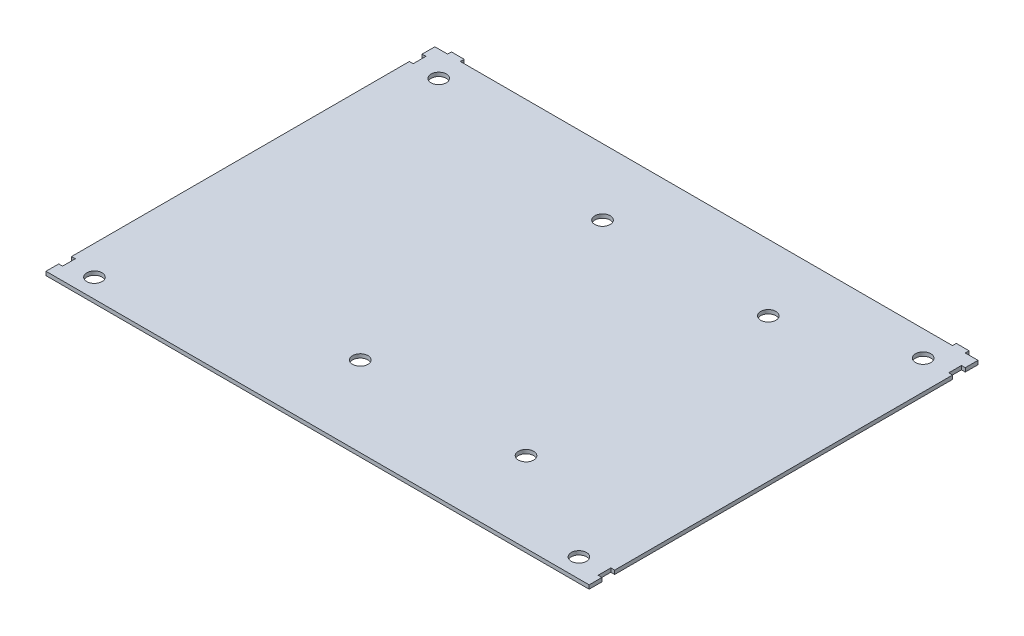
from build123d import *

# Parameters (mm, degrees)
SKETCH_1_W              = 530
SKETCH_1_H              = 300
EXTRUDE_1_DEPTH         = 3
SKETCH_3_W              = 79
SKETCH_3_H              = 200
CUT_EXTRUDE_2_DEPTH     = 610.022988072
FILLET_2_R              = 5
SKETCH_4_W              = 27.5
SKETCH_4_H              = 300
CUT_EXTRUDE_3_DEPTH     = 610.022988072
SKETCH_7_W              = 170
SKETCH_7_H              = 300
EXTRUDE_2_DEPTH         = 3
SKETCH_8_W              = 170
SKETCH_8_H              = 140
CUT_EXTRUDE_4_DEPTH     = 762.583219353
SKETCH_11_W             = 47.5
SKETCH_11_H             = 60
SKETCH_11_H_2           = 40
EXTRUDE_3_DEPTH         = 3
HOLE_WIZARD_10_0_10_1_D = 10
SKETCH_16_W             = 21
SKETCH_16_H             = 200
EXTRUDE_5_DEPTH         = 3
FILLET_4_R              = 5
SKETCH_18_W             = 7
SKETCH_18_H             = 160
EXTRUDE_7_DEPTH         = 3
SKETCH_19_W             = 177
SKETCH_19_H             = 160
CUT_EXTRUDE_5_DEPTH     = 769.022135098
SKETCH_21_W             = 110
SKETCH_21_H             = 300
EXTRUDE_8_DEPTH         = 3
SKETCH_20_R             = 6
CUT_EXTRUDE_6_DEPTH     = 707.830248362
SKETCH_22_W             = 78
SKETCH_22_H             = 90
EXTRUDE_9_DEPTH         = 3
FILLET_5_R              = 5
HOLE_WIZARD_12_0_12_1_D = 12
HOLE_WIZARD_12_0_12_2_D = 12
SKETCH_23_W             = 3
SKETCH_23_H             = 10
CUT_EXTRUDE_7_DEPTH     = 707.830248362
SKETCH_27_W             = 3
SKETCH_27_H             = 10
CUT_EXTRUDE_10_DEPTH    = 707.830248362
CUT_EXTRUDE_11_DEPTH    = 707.830248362
SKETCH_29_W             = 426
SKETCH_29_H             = 8
EXTRUDE_10_DEPTH        = 3
SKETCH_31_W             = 234
SKETCH_31_H             = 30
CUT_EXTRUDE_13_DEPTH    = 707.830248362
SKETCH_32_W             = 14.653295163
SKETCH_32_H             = 19.387436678
EXTRUDE_11_DEPTH        = 3
SKETCH_33_W             = 3
SKETCH_33_H             = 10
CUT_EXTRUDE_14_DEPTH    = 707.830248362
SKETCH_34_W             = 8
SKETCH_34_H             = 3
CUT_EXTRUDE_15_DEPTH    = 707.830248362
SKETCH_36_W             = 14.940084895
SKETCH_36_H             = 27.122000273
EXTRUDE_12_DEPTH        = 3
SKETCH_38_W             = 234
SKETCH_38_H             = 270
CUT_EXTRUDE_18_DEPTH    = 707.830248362
SKETCH_39_W             = 426
SKETCH_39_H             = 3
CUT_EXTRUDE_19_DEPTH    = 707.830248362
SKETCH_40_W             = 3
SKETCH_40_H             = 10
CUT_EXTRUDE_20_DEPTH    = 706.562187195
SKETCH_41_W             = 10
SKETCH_41_H             = 3
EXTRUDE_13_DEPTH        = 3


with BuildPart() as part:
    # Sketch 1 → Extrude 1 (new body)
    with BuildSketch(Plane(origin=(0, 0, 0), x_dir=(1, 0, 0), z_dir=(0, 1, 0))):
        with Locations((265, 150)):
            Rectangle(SKETCH_1_W, SKETCH_1_H)
    extrude(amount=EXTRUDE_1_DEPTH)

    # Sketch 3 → Cut-Extrude 2 (cut, through all)
    with BuildSketch(Plane(origin=(0, 3, 0), x_dir=(1, 0, 0), z_dir=(0, 1, 0))):
        with Locations((39.5, 160)):
            Rectangle(SKETCH_3_W, SKETCH_3_H)
    extrude(amount=-CUT_EXTRUDE_2_DEPTH, mode=Mode.SUBTRACT)

    # Fillet 2
    fillet_2_edges = [part.edges().sort_by_distance(p)[0] for p in [
        (79, 1.5, -260),
        (79, 1.5, -60),
    ]]
    fillet(fillet_2_edges, radius=FILLET_2_R)

    # Sketch 4 → Cut-Extrude 3 (cut, through all)
    with BuildSketch(Plane(origin=(0, 3, 0), x_dir=(1, 0, 0), z_dir=(0, 1, 0))):
        with Locations((13.75, 150)):
            Rectangle(SKETCH_4_W, SKETCH_4_H)
    extrude(amount=-CUT_EXTRUDE_3_DEPTH, mode=Mode.SUBTRACT)

    # Sketch 7 → Extrude 2 (add)
    with BuildSketch(Plane(origin=(0, 3, 0), x_dir=(1, 0, 0), z_dir=(0, 1, 0))):
        with Locations((615, 150)):
            Rectangle(SKETCH_7_W, SKETCH_7_H)
    extrude(amount=-EXTRUDE_2_DEPTH)

    # Sketch 8 → Cut-Extrude 4 (cut, through all)
    with BuildSketch(Plane(origin=(0, 3, 0), x_dir=(1, 0, 0), z_dir=(0, 1, 0))):
        with Locations((615, 230)):
            Rectangle(SKETCH_8_W, SKETCH_8_H)
    extrude(amount=-CUT_EXTRUDE_4_DEPTH, mode=Mode.SUBTRACT)

    # Sketch 11 → Extrude 3 (add)
    with BuildSketch(Plane.XZ):
        with Locations((3.75, -30)):
            Rectangle(SKETCH_11_W, SKETCH_11_H)
        with Locations((3.75, -280)):
            Rectangle(SKETCH_11_W, SKETCH_11_H_2)
    extrude(amount=-EXTRUDE_3_DEPTH)

    # Hole Wizard 10.0 _10_1 (through all)
    with Locations(Plane(origin=(0, 3, 0), x_dir=(1, 0, 0), z_dir=(0, 1, 0))):
        with Locations((547.5, 152.5), (692.5, 152.5), (692.5, 7.5), (547.5, 7.5)):
            Hole(HOLE_WIZARD_10_0_10_1_D / 2)

    # Sketch 16 → Extrude 5 (add)
    with BuildSketch(Plane.XZ):
        with Locations((-9.5, -160)):
            Rectangle(SKETCH_16_W, SKETCH_16_H)
    extrude(amount=-EXTRUDE_5_DEPTH)

    # Fillet 4
    fillet_4_edges = [part.edges().sort_by_distance(p)[0] for p in [
        (1, 1.5, -260),
        (1, 1.5, -60),
    ]]
    fillet(fillet_4_edges, radius=FILLET_4_R)

    # Sketch 18 → Extrude 7 (add)
    with BuildSketch(Plane(origin=(0, 3, 0), x_dir=(1, 0, 0), z_dir=(0, 1, 0))):
        with Locations((703.5, 80)):
            Rectangle(SKETCH_18_W, SKETCH_18_H)
    extrude(amount=-EXTRUDE_7_DEPTH)

    # Sketch 19 → Cut-Extrude 5 (cut, through all)
    with BuildSketch(Plane(origin=(0, 3, 0), x_dir=(1, 0, 0), z_dir=(0, 1, 0))):
        with Locations((618.5, 80)):
            Rectangle(SKETCH_19_W, SKETCH_19_H)
    extrude(amount=-CUT_EXTRUDE_5_DEPTH, mode=Mode.SUBTRACT)

    # Sketch 21 → Extrude 8 (add)
    with BuildSketch(Plane(origin=(0, 3, 0), x_dir=(1, 0, 0), z_dir=(0, 1, 0))):
        with Locations((585, 150)):
            Rectangle(SKETCH_21_W, SKETCH_21_H)
    extrude(amount=-EXTRUDE_8_DEPTH)

    # Sketch 20 → Cut-Extrude 6 (cut, through all)
    with BuildSketch(Plane(origin=(0, 3, 0), x_dir=(1, 0, 0), z_dir=(0, 1, 0))):
        with Locations(Location((527.5, 55, 0), (0, 0, 270))):
            Circle(SKETCH_20_R)
        with Locations(Location((397.5, 55, 0), (0, 0, 270))):
            Circle(SKETCH_20_R)
        with Locations(Location((397.5, 245, 0), (0, 0, 270))):
            Circle(SKETCH_20_R)
        with Locations(Location((527.5, 245, 0), (0, 0, 270))):
            Circle(SKETCH_20_R)
    extrude(amount=-CUT_EXTRUDE_6_DEPTH, mode=Mode.SUBTRACT)

    # Sketch 22 → Extrude 9 (add)
    with BuildSketch(Plane(origin=(0, 3, 0), x_dir=(1, 0, 0), z_dir=(0, 1, 0))):
        with Locations((40, 105)):
            Rectangle(SKETCH_22_W, SKETCH_22_H)
    extrude(amount=-EXTRUDE_9_DEPTH)

    # Fillet 5
    fillet_5_edges = [part.edges().sort_by_distance(p)[0] for p in [
        (79, 1.5, -150),
        (1, 1.5, -150),
    ]]
    fillet(fillet_5_edges, radius=FILLET_5_R)

    # Hole Wizard 12.0 _12_1 (through all)
    with Locations(Plane(origin=(0, 3, 0), x_dir=(1, 0, 0), z_dir=(0, 1, 0))):
        with Locations((617, 277), (617, 7), (237, 7), (237, 277)):
            Hole(HOLE_WIZARD_12_0_12_1_D / 2)

    # Hole Wizard 12.0 _12_2 (through all)
    with Locations(Plane(origin=(0, 0, 0), x_dir=(-1, 0, 0), z_dir=(0, -1, 0))):
        with Locations((-41, 43.5), (-191, 43.5), (-191, 276.5), (-41, 276.5)):
            Hole(HOLE_WIZARD_12_0_12_2_D / 2)

    # Sketch 23 → Cut-Extrude 7 (cut, through all)
    with BuildSketch(Plane.XZ):
        with Locations((-18.5, -48)):
            Rectangle(SKETCH_23_W, SKETCH_23_H)
        with Locations((-18.5, -282)):
            Rectangle(SKETCH_23_W, SKETCH_23_H)
    extrude(amount=-CUT_EXTRUDE_7_DEPTH, mode=Mode.SUBTRACT)

    # Sketch 27 → Cut-Extrude 10 (cut, through all)
    with BuildSketch(Plane.XZ):
        with Locations((638.5, -282)):
            Rectangle(SKETCH_27_W, SKETCH_27_H)
        with Locations((638.5, -7)):
            Rectangle(SKETCH_27_W, SKETCH_27_H)
    extrude(amount=-CUT_EXTRUDE_10_DEPTH, mode=Mode.SUBTRACT)

    # Sketch 28 → Cut-Extrude 11 (cut, through all)
    with BuildSketch(Plane(origin=(0, 3, 0), x_dir=(1, 0, 0), z_dir=(0, 1, 0))):
        with BuildLine():
            Line((127, 288), (127, 276))
            ThreePointArc((127, 276), (125.5, 274.5), (124, 276))
            Line((124, 276), (124, 288))
            ThreePointArc((124, 288), (125.5, 289.5), (127, 288))
        make_face()
        with BuildLine():
            Line((127, 54), (127, 42))
            ThreePointArc((127, 42), (125.5, 40.5), (124, 42))
            Line((124, 42), (124, 54))
            ThreePointArc((124, 54), (125.5, 55.5), (127, 54))
        make_face()
    extrude(amount=-CUT_EXTRUDE_11_DEPTH, mode=Mode.SUBTRACT)

    # Sketch 29 → Extrude 10 (add)
    with BuildSketch(Plane.XZ):
        with Locations((427, 4)):
            Rectangle(SKETCH_29_W, SKETCH_29_H)
    extrude(amount=-EXTRUDE_10_DEPTH)

    # Sketch 31 → Cut-Extrude 13 (cut, through all)
    with BuildSketch(Plane(origin=(0, 3, 0), x_dir=(1, 0, 0), z_dir=(0, 1, 0))):
        with Locations((97, 15)):
            Rectangle(SKETCH_31_W, SKETCH_31_H)
    extrude(amount=-CUT_EXTRUDE_13_DEPTH, mode=Mode.SUBTRACT)

    # Sketch 32 → Extrude 11 (add)
    with BuildSketch(Plane(origin=(0, 3, 0), x_dir=(1, 0, 0), z_dir=(0, 1, 0))):
        with Locations((125.410487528, 48.594218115)):
            Rectangle(SKETCH_32_W, SKETCH_32_H)
    extrude(amount=-EXTRUDE_11_DEPTH)

    # Sketch 33 → Cut-Extrude 14 (cut, through all)
    with BuildSketch(Plane(origin=(0, 3, 0), x_dir=(1, 0, 0), z_dir=(0, 1, 0))):
        with Locations((215.5, 7)):
            Rectangle(SKETCH_33_W, SKETCH_33_H)
    extrude(amount=-CUT_EXTRUDE_14_DEPTH, mode=Mode.SUBTRACT)

    # Sketch 34 → Cut-Extrude 15 (cut, through all)
    with BuildSketch(Plane.XZ):
        with Locations((-3, -31.5)):
            Rectangle(SKETCH_34_W, SKETCH_34_H)
        with Locations((197, -31.5)):
            Rectangle(SKETCH_34_W, SKETCH_34_H)
    extrude(amount=-CUT_EXTRUDE_15_DEPTH, mode=Mode.SUBTRACT)

    # Sketch 36 → Extrude 12 (add)
    with BuildSketch(Plane.XZ):
        with Locations((250.394567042, -48.475188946)):
            Rectangle(SKETCH_36_W, SKETCH_36_H)
    extrude(amount=-EXTRUDE_12_DEPTH)

    # Sketch 38 → Cut-Extrude 18 (cut, through all)
    with BuildSketch(Plane(origin=(0, 3, 0), x_dir=(1, 0, 0), z_dir=(0, 1, 0))):
        with Locations((97, 165)):
            Rectangle(SKETCH_38_W, SKETCH_38_H)
    extrude(amount=-CUT_EXTRUDE_18_DEPTH, mode=Mode.SUBTRACT)

    # Sketch 39 → Cut-Extrude 19 (cut, through all)
    with BuildSketch(Plane(origin=(0, 3, 0), x_dir=(1, 0, 0), z_dir=(0, 1, 0))):
        with Locations((427, 298.5)):
            Rectangle(SKETCH_39_W, SKETCH_39_H)
    extrude(amount=-CUT_EXTRUDE_19_DEPTH, mode=Mode.SUBTRACT)

    # Sketch 40 → Cut-Extrude 20 (cut, through all)
    with BuildSketch(Plane.XZ):
        with Locations((215.5, -282)):
            Rectangle(SKETCH_40_W, SKETCH_40_H)
    extrude(amount=-CUT_EXTRUDE_20_DEPTH, mode=Mode.SUBTRACT)

    # Sketch 41 → Extrude 13 (add)
    with BuildSketch(Plane(origin=(0, 3, 0), x_dir=(1, 0, 0), z_dir=(0, 1, 0))):
        with Locations((625, 298.5)):
            Rectangle(SKETCH_41_W, SKETCH_41_H)
        with Locations((229, 298.5)):
            Rectangle(SKETCH_41_W, SKETCH_41_H)
    extrude(amount=-EXTRUDE_13_DEPTH)


solid = part.part
